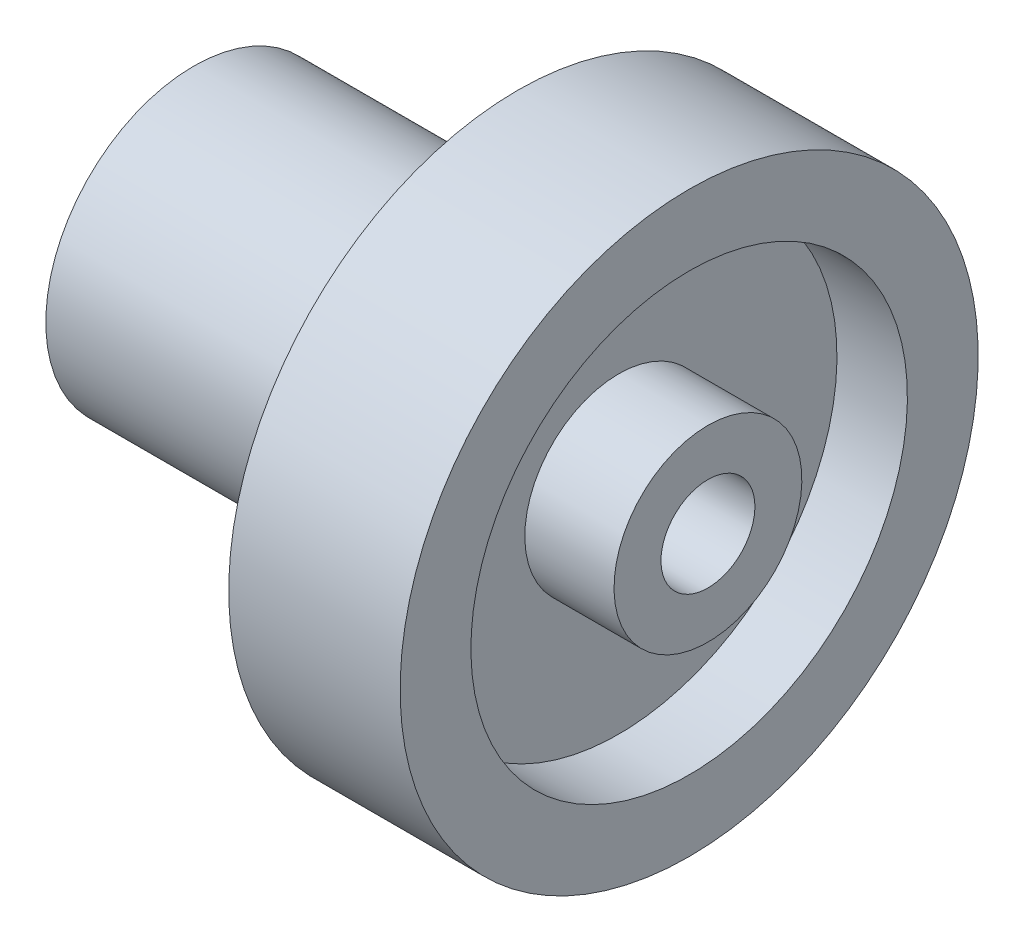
ISO-10303-21;
HEADER;
FILE_DESCRIPTION(('STEP AP214'),'2;1');
FILE_NAME('part.step','',(''),(''),'','','');
FILE_SCHEMA(('AUTOMOTIVE_DESIGN { 1 0 10303 214 1 1 1 1 }'));
ENDSEC;
DATA;
#1=APPLICATION_CONTEXT('core data for automotive mechanical design processes');
#2=APPLICATION_PROTOCOL_DEFINITION('international standard','automotive_design',2000,#1);
#3=PRODUCT_CONTEXT('',#1,'mechanical');
#4=PRODUCT('Part','Part','',(#3));
#5=PRODUCT_RELATED_PRODUCT_CATEGORY('part','',(#4));
#6=PRODUCT_DEFINITION_FORMATION('','',#4);
#7=PRODUCT_DEFINITION_CONTEXT('part definition',#1,'design');
#8=PRODUCT_DEFINITION('design','',#6,#7);
#9=PRODUCT_DEFINITION_SHAPE('','',#8);
#10=(LENGTH_UNIT() NAMED_UNIT(*) SI_UNIT(.MILLI.,.METRE.));
#11=(NAMED_UNIT(*) PLANE_ANGLE_UNIT() SI_UNIT($,.RADIAN.));
#12=(NAMED_UNIT(*) SI_UNIT($,.STERADIAN.) SOLID_ANGLE_UNIT());
#13=UNCERTAINTY_MEASURE_WITH_UNIT(LENGTH_MEASURE(1.E-05),#10,'distance_accuracy_value','');
#14=(GEOMETRIC_REPRESENTATION_CONTEXT(3) GLOBAL_UNCERTAINTY_ASSIGNED_CONTEXT((#13)) GLOBAL_UNIT_ASSIGNED_CONTEXT((#10,
#11,#12)) REPRESENTATION_CONTEXT('',''));
#15=CARTESIAN_POINT('',(0.,0.,0.));
#16=DIRECTION('',(0.,0.,1.));
#17=DIRECTION('',(1.,0.,0.));
#18=AXIS2_PLACEMENT_3D('',#15,#16,#17);
#19=CARTESIAN_POINT('',(24.2282202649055,18.6843096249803,0.));
#20=DIRECTION('',(1.,0.,0.));
#21=DIRECTION('',(0.,1.,0.));
#22=AXIS2_PLACEMENT_3D('',#19,#20,#21);
#23=PLANE('',#22);
#24=CARTESIAN_POINT('',(24.2282202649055,14.6843096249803,0.));
#25=DIRECTION('',(1.,0.,0.));
#26=DIRECTION('',(0.,1.,0.));
#27=AXIS2_PLACEMENT_3D('',#24,#25,#26);
#28=CIRCLE('',#27,4.);
#29=CARTESIAN_POINT('',(24.2282202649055,18.6843096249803,0.));
#30=VERTEX_POINT('',#29);
#31=EDGE_CURVE('E10',#30,#30,#28,.T.);
#32=ORIENTED_EDGE('',*,*,#31,.T.);
#33=EDGE_LOOP('',(#32));
#34=FACE_BOUND('',#33,.T.);
#35=CARTESIAN_POINT('',(24.2282202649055,14.6843096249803,0.));
#36=DIRECTION('',(1.,0.,0.));
#37=DIRECTION('',(0.,1.,0.));
#38=AXIS2_PLACEMENT_3D('',#35,#36,#37);
#39=CIRCLE('',#38,2.);
#40=CARTESIAN_POINT('',(24.2282202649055,16.6843096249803,0.));
#41=VERTEX_POINT('',#40);
#42=EDGE_CURVE('E73',#41,#41,#39,.T.);
#43=ORIENTED_EDGE('',*,*,#42,.F.);
#44=EDGE_LOOP('',(#43));
#45=FACE_BOUND('',#44,.T.);
#46=ADVANCED_FACE('F27',(#34,#45),#23,.T.);
#47=CARTESIAN_POINT('',(52.6667736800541,14.6843096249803,0.));
#48=DIRECTION('',(1.,0.,0.));
#49=DIRECTION('',(0.,1.,0.));
#50=AXIS2_PLACEMENT_3D('',#47,#48,#49);
#51=CYLINDRICAL_SURFACE('',#50,4.);
#52=CARTESIAN_POINT('',(20.4282202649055,14.6843096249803,0.));
#53=DIRECTION('',(1.,0.,0.));
#54=DIRECTION('',(0.,1.,0.));
#55=AXIS2_PLACEMENT_3D('',#52,#53,#54);
#56=CIRCLE('',#55,4.);
#57=CARTESIAN_POINT('',(20.4282202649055,18.6843096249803,0.));
#58=VERTEX_POINT('',#57);
#59=EDGE_CURVE('E33',#58,#58,#56,.T.);
#60=ORIENTED_EDGE('',*,*,#59,.T.);
#61=EDGE_LOOP('',(#60));
#62=FACE_BOUND('',#61,.T.);
#63=ORIENTED_EDGE('',*,*,#31,.F.);
#64=EDGE_LOOP('',(#63));
#65=FACE_BOUND('',#64,.T.);
#66=ADVANCED_FACE('F81',(#62,#65),#51,.T.);
#67=CARTESIAN_POINT('',(20.4282202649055,23.9798096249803,0.));
#68=DIRECTION('',(1.,0.,0.));
#69=DIRECTION('',(0.,1.,0.));
#70=AXIS2_PLACEMENT_3D('',#67,#68,#69);
#71=PLANE('',#70);
#72=CARTESIAN_POINT('',(20.4282202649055,14.6843096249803,0.));
#73=DIRECTION('',(1.,0.,0.));
#74=DIRECTION('',(0.,1.,0.));
#75=AXIS2_PLACEMENT_3D('',#72,#73,#74);
#76=CIRCLE('',#75,9.2955);
#77=CARTESIAN_POINT('',(20.4282202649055,23.9798096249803,0.));
#78=VERTEX_POINT('',#77);
#79=EDGE_CURVE('E37',#78,#78,#76,.T.);
#80=ORIENTED_EDGE('',*,*,#79,.T.);
#81=EDGE_LOOP('',(#80));
#82=FACE_BOUND('',#81,.T.);
#83=ORIENTED_EDGE('',*,*,#59,.F.);
#84=EDGE_LOOP('',(#83));
#85=FACE_BOUND('',#84,.T.);
#86=ADVANCED_FACE('F85',(#82,#85),#71,.T.);
#87=CARTESIAN_POINT('',(52.6667736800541,14.6843096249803,0.));
#88=DIRECTION('',(1.,0.,0.));
#89=DIRECTION('',(0.,1.,0.));
#90=AXIS2_PLACEMENT_3D('',#87,#88,#89);
#91=CYLINDRICAL_SURFACE('',#90,9.2955);
#92=CARTESIAN_POINT('',(23.4282202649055,14.6843096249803,0.));
#93=DIRECTION('',(1.,0.,0.));
#94=DIRECTION('',(0.,1.,0.));
#95=AXIS2_PLACEMENT_3D('',#92,#93,#94);
#96=CIRCLE('',#95,9.2955);
#97=CARTESIAN_POINT('',(23.4282202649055,23.9798096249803,0.));
#98=VERTEX_POINT('',#97);
#99=EDGE_CURVE('E41',#98,#98,#96,.T.);
#100=ORIENTED_EDGE('',*,*,#99,.T.);
#101=EDGE_LOOP('',(#100));
#102=FACE_BOUND('',#101,.T.);
#103=ORIENTED_EDGE('',*,*,#79,.F.);
#104=EDGE_LOOP('',(#103));
#105=FACE_BOUND('',#104,.T.);
#106=ADVANCED_FACE('F89',(#102,#105),#91,.F.);
#107=CARTESIAN_POINT('',(23.4282202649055,26.9943096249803,0.));
#108=DIRECTION('',(1.,0.,0.));
#109=DIRECTION('',(0.,1.,0.));
#110=AXIS2_PLACEMENT_3D('',#107,#108,#109);
#111=PLANE('',#110);
#112=CARTESIAN_POINT('',(23.4282202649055,14.6843096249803,0.));
#113=DIRECTION('',(1.,0.,0.));
#114=DIRECTION('',(0.,1.,0.));
#115=AXIS2_PLACEMENT_3D('',#112,#113,#114);
#116=CIRCLE('',#115,12.31);
#117=CARTESIAN_POINT('',(23.4282202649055,26.9943096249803,0.));
#118=VERTEX_POINT('',#117);
#119=EDGE_CURVE('E46',#118,#118,#116,.T.);
#120=ORIENTED_EDGE('',*,*,#119,.T.);
#121=EDGE_LOOP('',(#120));
#122=FACE_BOUND('',#121,.T.);
#123=ORIENTED_EDGE('',*,*,#99,.F.);
#124=EDGE_LOOP('',(#123));
#125=FACE_BOUND('',#124,.T.);
#126=ADVANCED_FACE('F96',(#122,#125),#111,.T.);
#127=CARTESIAN_POINT('',(52.6667736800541,14.6843096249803,0.));
#128=DIRECTION('',(1.,0.,0.));
#129=DIRECTION('',(0.,1.,0.));
#130=AXIS2_PLACEMENT_3D('',#127,#128,#129);
#131=CYLINDRICAL_SURFACE('',#130,12.31);
#132=CARTESIAN_POINT('',(16.1282202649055,14.6843096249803,0.));
#133=DIRECTION('',(1.,0.,0.));
#134=DIRECTION('',(0.,1.,0.));
#135=AXIS2_PLACEMENT_3D('',#132,#133,#134);
#136=CIRCLE('',#135,12.31);
#137=CARTESIAN_POINT('',(16.1282202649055,26.9943096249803,0.));
#138=VERTEX_POINT('',#137);
#139=EDGE_CURVE('E49',#138,#138,#136,.T.);
#140=ORIENTED_EDGE('',*,*,#139,.T.);
#141=EDGE_LOOP('',(#140));
#142=FACE_BOUND('',#141,.T.);
#143=ORIENTED_EDGE('',*,*,#119,.F.);
#144=EDGE_LOOP('',(#143));
#145=FACE_BOUND('',#144,.T.);
#146=ADVANCED_FACE('F100',(#142,#145),#131,.T.);
#147=CARTESIAN_POINT('',(16.1282202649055,24.2943096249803,0.));
#148=DIRECTION('',(-1.,0.,0.));
#149=DIRECTION('',(0.,-1.,0.));
#150=AXIS2_PLACEMENT_3D('',#147,#148,#149);
#151=PLANE('',#150);
#152=CARTESIAN_POINT('',(16.1282202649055,14.6843096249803,0.));
#153=DIRECTION('',(1.,0.,0.));
#154=DIRECTION('',(0.,1.,0.));
#155=AXIS2_PLACEMENT_3D('',#152,#153,#154);
#156=CIRCLE('',#155,9.61);
#157=CARTESIAN_POINT('',(16.1282202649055,24.2943096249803,0.));
#158=VERTEX_POINT('',#157);
#159=EDGE_CURVE('E52',#158,#158,#156,.T.);
#160=ORIENTED_EDGE('',*,*,#159,.T.);
#161=EDGE_LOOP('',(#160));
#162=FACE_BOUND('',#161,.T.);
#163=ORIENTED_EDGE('',*,*,#139,.F.);
#164=EDGE_LOOP('',(#163));
#165=FACE_BOUND('',#164,.T.);
#166=ADVANCED_FACE('F104',(#162,#165),#151,.T.);
#167=CARTESIAN_POINT('',(16.1282202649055,14.6843096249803,0.));
#168=DIRECTION('',(-1.,0.,0.));
#169=DIRECTION('',(0.,-1.,0.));
#170=AXIS2_PLACEMENT_3D('',#167,#168,#169);
#171=CONICAL_SURFACE('',#170,9.61,0.334736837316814);
#172=CARTESIAN_POINT('',(18.4282202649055,14.6843096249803,0.));
#173=DIRECTION('',(1.,0.,0.));
#174=DIRECTION('',(0.,1.,0.));
#175=AXIS2_PLACEMENT_3D('',#172,#173,#174);
#176=CIRCLE('',#175,8.81);
#177=CARTESIAN_POINT('',(18.4282202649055,23.4943096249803,0.));
#178=VERTEX_POINT('',#177);
#179=EDGE_CURVE('E55',#178,#178,#176,.T.);
#180=ORIENTED_EDGE('',*,*,#179,.T.);
#181=EDGE_LOOP('',(#180));
#182=FACE_BOUND('',#181,.T.);
#183=ORIENTED_EDGE('',*,*,#159,.F.);
#184=EDGE_LOOP('',(#183));
#185=FACE_BOUND('',#184,.T.);
#186=ADVANCED_FACE('F108',(#182,#185),#171,.F.);
#187=CARTESIAN_POINT('',(18.4282202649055,20.9843096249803,0.));
#188=DIRECTION('',(-1.,0.,0.));
#189=DIRECTION('',(0.,-1.,0.));
#190=AXIS2_PLACEMENT_3D('',#187,#188,#189);
#191=PLANE('',#190);
#192=CARTESIAN_POINT('',(18.4282202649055,14.6843096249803,0.));
#193=DIRECTION('',(1.,0.,0.));
#194=DIRECTION('',(0.,1.,0.));
#195=AXIS2_PLACEMENT_3D('',#192,#193,#194);
#196=CIRCLE('',#195,6.3);
#197=CARTESIAN_POINT('',(18.4282202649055,20.9843096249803,0.));
#198=VERTEX_POINT('',#197);
#199=EDGE_CURVE('E58',#198,#198,#196,.T.);
#200=ORIENTED_EDGE('',*,*,#199,.T.);
#201=EDGE_LOOP('',(#200));
#202=FACE_BOUND('',#201,.T.);
#203=ORIENTED_EDGE('',*,*,#179,.F.);
#204=EDGE_LOOP('',(#203));
#205=FACE_BOUND('',#204,.T.);
#206=ADVANCED_FACE('F112',(#202,#205),#191,.T.);
#207=CARTESIAN_POINT('',(52.6667736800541,14.6843096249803,0.));
#208=DIRECTION('',(1.,0.,0.));
#209=DIRECTION('',(0.,1.,0.));
#210=AXIS2_PLACEMENT_3D('',#207,#208,#209);
#211=CYLINDRICAL_SURFACE('',#210,6.3);
#212=CARTESIAN_POINT('',(2.3282202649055,14.6843096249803,0.));
#213=DIRECTION('',(1.,0.,0.));
#214=DIRECTION('',(0.,1.,0.));
#215=AXIS2_PLACEMENT_3D('',#212,#213,#214);
#216=CIRCLE('',#215,6.3);
#217=CARTESIAN_POINT('',(2.3282202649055,20.9843096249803,0.));
#218=VERTEX_POINT('',#217);
#219=EDGE_CURVE('E61',#218,#218,#216,.T.);
#220=ORIENTED_EDGE('',*,*,#219,.T.);
#221=EDGE_LOOP('',(#220));
#222=FACE_BOUND('',#221,.T.);
#223=ORIENTED_EDGE('',*,*,#199,.F.);
#224=EDGE_LOOP('',(#223));
#225=FACE_BOUND('',#224,.T.);
#226=ADVANCED_FACE('F116',(#222,#225),#211,.T.);
#227=CARTESIAN_POINT('',(2.32822026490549,19.0843096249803,0.));
#228=DIRECTION('',(-1.,0.,0.));
#229=DIRECTION('',(0.,-1.,0.));
#230=AXIS2_PLACEMENT_3D('',#227,#228,#229);
#231=PLANE('',#230);
#232=CARTESIAN_POINT('',(2.32822026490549,14.6843096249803,0.));
#233=DIRECTION('',(1.,0.,0.));
#234=DIRECTION('',(0.,1.,0.));
#235=AXIS2_PLACEMENT_3D('',#232,#233,#234);
#236=CIRCLE('',#235,4.4);
#237=CARTESIAN_POINT('',(2.32822026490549,19.0843096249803,0.));
#238=VERTEX_POINT('',#237);
#239=EDGE_CURVE('E64',#238,#238,#236,.T.);
#240=ORIENTED_EDGE('',*,*,#239,.T.);
#241=EDGE_LOOP('',(#240));
#242=FACE_BOUND('',#241,.T.);
#243=ORIENTED_EDGE('',*,*,#219,.F.);
#244=EDGE_LOOP('',(#243));
#245=FACE_BOUND('',#244,.T.);
#246=ADVANCED_FACE('F120',(#242,#245),#231,.T.);
#247=CARTESIAN_POINT('',(2.32822026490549,14.6843096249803,0.));
#248=DIRECTION('',(1.,0.,0.));
#249=DIRECTION('',(0.,1.,0.));
#250=AXIS2_PLACEMENT_3D('',#247,#248,#249);
#251=CONICAL_SURFACE('',#250,4.4,0.26184679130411);
#252=CARTESIAN_POINT('',(1.3282202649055,14.6843096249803,0.));
#253=DIRECTION('',(1.,0.,0.));
#254=DIRECTION('',(0.,1.,0.));
#255=AXIS2_PLACEMENT_3D('',#252,#253,#254);
#256=CIRCLE('',#255,4.13200000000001);
#257=CARTESIAN_POINT('',(1.3282202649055,18.8163096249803,0.));
#258=VERTEX_POINT('',#257);
#259=EDGE_CURVE('E67',#258,#258,#256,.T.);
#260=ORIENTED_EDGE('',*,*,#259,.T.);
#261=EDGE_LOOP('',(#260));
#262=FACE_BOUND('',#261,.T.);
#263=ORIENTED_EDGE('',*,*,#239,.F.);
#264=EDGE_LOOP('',(#263));
#265=FACE_BOUND('',#264,.T.);
#266=ADVANCED_FACE('F124',(#262,#265),#251,.T.);
#267=CARTESIAN_POINT('',(1.32822026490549,16.6843096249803,0.));
#268=DIRECTION('',(-1.,0.,0.));
#269=DIRECTION('',(0.,-1.,0.));
#270=AXIS2_PLACEMENT_3D('',#267,#268,#269);
#271=PLANE('',#270);
#272=CARTESIAN_POINT('',(1.3282202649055,14.6843096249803,0.));
#273=DIRECTION('',(1.,0.,0.));
#274=DIRECTION('',(0.,1.,0.));
#275=AXIS2_PLACEMENT_3D('',#272,#273,#274);
#276=CIRCLE('',#275,2.);
#277=CARTESIAN_POINT('',(1.3282202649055,16.6843096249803,0.));
#278=VERTEX_POINT('',#277);
#279=EDGE_CURVE('E70',#278,#278,#276,.T.);
#280=ORIENTED_EDGE('',*,*,#279,.T.);
#281=EDGE_LOOP('',(#280));
#282=FACE_BOUND('',#281,.T.);
#283=ORIENTED_EDGE('',*,*,#259,.F.);
#284=EDGE_LOOP('',(#283));
#285=FACE_BOUND('',#284,.T.);
#286=ADVANCED_FACE('F128',(#282,#285),#271,.T.);
#287=CARTESIAN_POINT('',(52.6667736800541,14.6843096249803,0.));
#288=DIRECTION('',(1.,0.,0.));
#289=DIRECTION('',(0.,1.,0.));
#290=AXIS2_PLACEMENT_3D('',#287,#288,#289);
#291=CYLINDRICAL_SURFACE('',#290,2.);
#292=ORIENTED_EDGE('',*,*,#42,.T.);
#293=EDGE_LOOP('',(#292));
#294=FACE_BOUND('',#293,.T.);
#295=ORIENTED_EDGE('',*,*,#279,.F.);
#296=EDGE_LOOP('',(#295));
#297=FACE_BOUND('',#296,.T.);
#298=ADVANCED_FACE('F77',(#294,#297),#291,.F.);
#299=CLOSED_SHELL('',(#46,#66,#86,#106,#126,#146,#166,#186,#206,#226,#246,#266,#286,#298));
#300=MANIFOLD_SOLID_BREP('B2',#299);
#301=ADVANCED_BREP_SHAPE_REPRESENTATION('',(#18,#300),#14);
#302=SHAPE_DEFINITION_REPRESENTATION(#9,#301);
ENDSEC;
END-ISO-10303-21;
